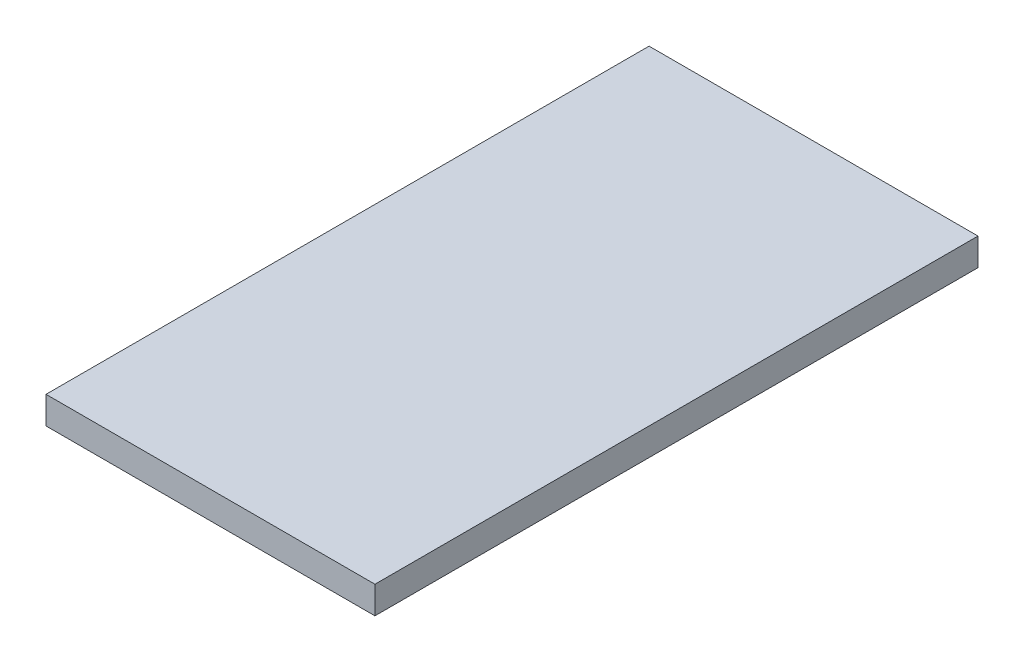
ISO-10303-21;
HEADER;
FILE_DESCRIPTION(('STEP AP214'),'2;1');
FILE_NAME('part.step','',(''),(''),'','','');
FILE_SCHEMA(('AUTOMOTIVE_DESIGN { 1 0 10303 214 1 1 1 1 }'));
ENDSEC;
DATA;
#1=APPLICATION_CONTEXT('core data for automotive mechanical design processes');
#2=APPLICATION_PROTOCOL_DEFINITION('international standard','automotive_design',2000,#1);
#3=PRODUCT_CONTEXT('',#1,'mechanical');
#4=PRODUCT('Part','Part','',(#3));
#5=PRODUCT_RELATED_PRODUCT_CATEGORY('part','',(#4));
#6=PRODUCT_DEFINITION_FORMATION('','',#4);
#7=PRODUCT_DEFINITION_CONTEXT('part definition',#1,'design');
#8=PRODUCT_DEFINITION('design','',#6,#7);
#9=PRODUCT_DEFINITION_SHAPE('','',#8);
#10=(LENGTH_UNIT() NAMED_UNIT(*) SI_UNIT(.MILLI.,.METRE.));
#11=(NAMED_UNIT(*) PLANE_ANGLE_UNIT() SI_UNIT($,.RADIAN.));
#12=(NAMED_UNIT(*) SI_UNIT($,.STERADIAN.) SOLID_ANGLE_UNIT());
#13=UNCERTAINTY_MEASURE_WITH_UNIT(LENGTH_MEASURE(1.E-05),#10,'distance_accuracy_value','');
#14=(GEOMETRIC_REPRESENTATION_CONTEXT(3) GLOBAL_UNCERTAINTY_ASSIGNED_CONTEXT((#13)) GLOBAL_UNIT_ASSIGNED_CONTEXT((#10,
#11,#12)) REPRESENTATION_CONTEXT('',''));
#15=CARTESIAN_POINT('',(0.,0.,0.));
#16=DIRECTION('',(0.,0.,1.));
#17=DIRECTION('',(1.,0.,0.));
#18=AXIS2_PLACEMENT_3D('',#15,#16,#17);
#19=CARTESIAN_POINT('',(0.,5.,0.));
#20=DIRECTION('',(1.,0.,0.));
#21=DIRECTION('',(0.,0.,-1.));
#22=AXIS2_PLACEMENT_3D('',#19,#20,#21);
#23=PLANE('',#22);
#24=DIRECTION('',(0.,0.,1.));
#25=VECTOR('',#24,1.);
#26=CARTESIAN_POINT('',(0.,0.,0.));
#27=LINE('',#26,#25);
#28=CARTESIAN_POINT('',(0.,0.,-110.));
#29=VERTEX_POINT('',#28);
#30=CARTESIAN_POINT('',(0.,0.,0.));
#31=VERTEX_POINT('',#30);
#32=EDGE_CURVE('E94',#29,#31,#27,.T.);
#33=ORIENTED_EDGE('',*,*,#32,.T.);
#34=DIRECTION('',(0.,-1.,0.));
#35=VECTOR('',#34,1.);
#36=CARTESIAN_POINT('',(0.,5.,0.));
#37=LINE('',#36,#35);
#38=CARTESIAN_POINT('',(0.,5.,0.));
#39=VERTEX_POINT('',#38);
#40=EDGE_CURVE('E11',#39,#31,#37,.T.);
#41=ORIENTED_EDGE('',*,*,#40,.F.);
#42=DIRECTION('',(0.,0.,1.));
#43=VECTOR('',#42,1.);
#44=CARTESIAN_POINT('',(0.,5.,0.));
#45=LINE('',#44,#43);
#46=CARTESIAN_POINT('',(0.,5.,-110.));
#47=VERTEX_POINT('',#46);
#48=EDGE_CURVE('E82',#47,#39,#45,.T.);
#49=ORIENTED_EDGE('',*,*,#48,.F.);
#50=DIRECTION('',(0.,-1.,0.));
#51=VECTOR('',#50,1.);
#52=CARTESIAN_POINT('',(0.,5.,-110.));
#53=LINE('',#52,#51);
#54=EDGE_CURVE('E90',#47,#29,#53,.T.);
#55=ORIENTED_EDGE('',*,*,#54,.T.);
#56=EDGE_LOOP('',(#33,#41,#49,#55));
#57=FACE_BOUND('',#56,.T.);
#58=ADVANCED_FACE('F31',(#57),#23,.F.);
#59=CARTESIAN_POINT('',(0.,5.,0.));
#60=DIRECTION('',(0.,0.,-1.));
#61=DIRECTION('',(-1.,0.,0.));
#62=AXIS2_PLACEMENT_3D('',#59,#60,#61);
#63=PLANE('',#62);
#64=DIRECTION('',(1.,0.,0.));
#65=VECTOR('',#64,1.);
#66=CARTESIAN_POINT('',(0.,0.,0.));
#67=LINE('',#66,#65);
#68=CARTESIAN_POINT('',(60.,0.,0.));
#69=VERTEX_POINT('',#68);
#70=EDGE_CURVE('E86',#31,#69,#67,.T.);
#71=ORIENTED_EDGE('',*,*,#70,.T.);
#72=DIRECTION('',(0.,-1.,0.));
#73=VECTOR('',#72,1.);
#74=CARTESIAN_POINT('',(60.,5.,0.));
#75=LINE('',#74,#73);
#76=CARTESIAN_POINT('',(60.,5.,0.));
#77=VERTEX_POINT('',#76);
#78=EDGE_CURVE('E39',#77,#69,#75,.T.);
#79=ORIENTED_EDGE('',*,*,#78,.F.);
#80=DIRECTION('',(1.,0.,0.));
#81=VECTOR('',#80,1.);
#82=CARTESIAN_POINT('',(0.,5.,0.));
#83=LINE('',#82,#81);
#84=EDGE_CURVE('E77',#39,#77,#83,.T.);
#85=ORIENTED_EDGE('',*,*,#84,.F.);
#86=ORIENTED_EDGE('',*,*,#40,.T.);
#87=EDGE_LOOP('',(#71,#79,#85,#86));
#88=FACE_BOUND('',#87,.T.);
#89=ADVANCED_FACE('F85',(#88),#63,.F.);
#90=CARTESIAN_POINT('',(60.,5.,0.));
#91=DIRECTION('',(-1.,0.,0.));
#92=DIRECTION('',(0.,0.,1.));
#93=AXIS2_PLACEMENT_3D('',#90,#91,#92);
#94=PLANE('',#93);
#95=DIRECTION('',(0.,0.,-1.));
#96=VECTOR('',#95,1.);
#97=CARTESIAN_POINT('',(60.,0.,0.));
#98=LINE('',#97,#96);
#99=CARTESIAN_POINT('',(60.,0.,-110.));
#100=VERTEX_POINT('',#99);
#101=EDGE_CURVE('E64',#69,#100,#98,.T.);
#102=ORIENTED_EDGE('',*,*,#101,.T.);
#103=DIRECTION('',(0.,-1.,0.));
#104=VECTOR('',#103,1.);
#105=CARTESIAN_POINT('',(60.,5.,-110.));
#106=LINE('',#105,#104);
#107=CARTESIAN_POINT('',(60.,5.,-110.));
#108=VERTEX_POINT('',#107);
#109=EDGE_CURVE('E87',#108,#100,#106,.T.);
#110=ORIENTED_EDGE('',*,*,#109,.F.);
#111=DIRECTION('',(0.,0.,-1.));
#112=VECTOR('',#111,1.);
#113=CARTESIAN_POINT('',(60.,5.,0.));
#114=LINE('',#113,#112);
#115=EDGE_CURVE('E80',#77,#108,#114,.T.);
#116=ORIENTED_EDGE('',*,*,#115,.F.);
#117=ORIENTED_EDGE('',*,*,#78,.T.);
#118=EDGE_LOOP('',(#102,#110,#116,#117));
#119=FACE_BOUND('',#118,.T.);
#120=ADVANCED_FACE('F88',(#119),#94,.F.);
#121=CARTESIAN_POINT('',(0.,5.,-110.));
#122=DIRECTION('',(0.,0.,1.));
#123=DIRECTION('',(1.,0.,0.));
#124=AXIS2_PLACEMENT_3D('',#121,#122,#123);
#125=PLANE('',#124);
#126=DIRECTION('',(-1.,0.,0.));
#127=VECTOR('',#126,1.);
#128=CARTESIAN_POINT('',(0.,0.,-110.));
#129=LINE('',#128,#127);
#130=EDGE_CURVE('E70',#100,#29,#129,.T.);
#131=ORIENTED_EDGE('',*,*,#130,.T.);
#132=ORIENTED_EDGE('',*,*,#54,.F.);
#133=DIRECTION('',(-1.,0.,0.));
#134=VECTOR('',#133,1.);
#135=CARTESIAN_POINT('',(0.,5.,-110.));
#136=LINE('',#135,#134);
#137=EDGE_CURVE('E47',#108,#47,#136,.T.);
#138=ORIENTED_EDGE('',*,*,#137,.F.);
#139=ORIENTED_EDGE('',*,*,#109,.T.);
#140=EDGE_LOOP('',(#131,#132,#138,#139));
#141=FACE_BOUND('',#140,.T.);
#142=ADVANCED_FACE('F101',(#141),#125,.F.);
#143=CARTESIAN_POINT('',(0.,5.,-110.));
#144=DIRECTION('',(0.,-1.,0.));
#145=DIRECTION('',(0.,0.,-1.));
#146=AXIS2_PLACEMENT_3D('',#143,#144,#145);
#147=PLANE('',#146);
#148=ORIENTED_EDGE('',*,*,#48,.T.);
#149=ORIENTED_EDGE('',*,*,#84,.T.);
#150=ORIENTED_EDGE('',*,*,#115,.T.);
#151=ORIENTED_EDGE('',*,*,#137,.T.);
#152=EDGE_LOOP('',(#148,#149,#150,#151));
#153=FACE_BOUND('',#152,.T.);
#154=ADVANCED_FACE('F78',(#153),#147,.F.);
#155=CARTESIAN_POINT('',(0.,0.,-110.));
#156=DIRECTION('',(0.,-1.,0.));
#157=DIRECTION('',(0.,0.,-1.));
#158=AXIS2_PLACEMENT_3D('',#155,#156,#157);
#159=PLANE('',#158);
#160=ORIENTED_EDGE('',*,*,#32,.F.);
#161=ORIENTED_EDGE('',*,*,#130,.F.);
#162=ORIENTED_EDGE('',*,*,#101,.F.);
#163=ORIENTED_EDGE('',*,*,#70,.F.);
#164=EDGE_LOOP('',(#160,#161,#162,#163));
#165=FACE_BOUND('',#164,.T.);
#166=ADVANCED_FACE('F104',(#165),#159,.T.);
#167=CLOSED_SHELL('',(#58,#89,#120,#142,#154,#166));
#168=MANIFOLD_SOLID_BREP('B2',#167);
#169=ADVANCED_BREP_SHAPE_REPRESENTATION('',(#18,#168),#14);
#170=SHAPE_DEFINITION_REPRESENTATION(#9,#169);
ENDSEC;
END-ISO-10303-21;
